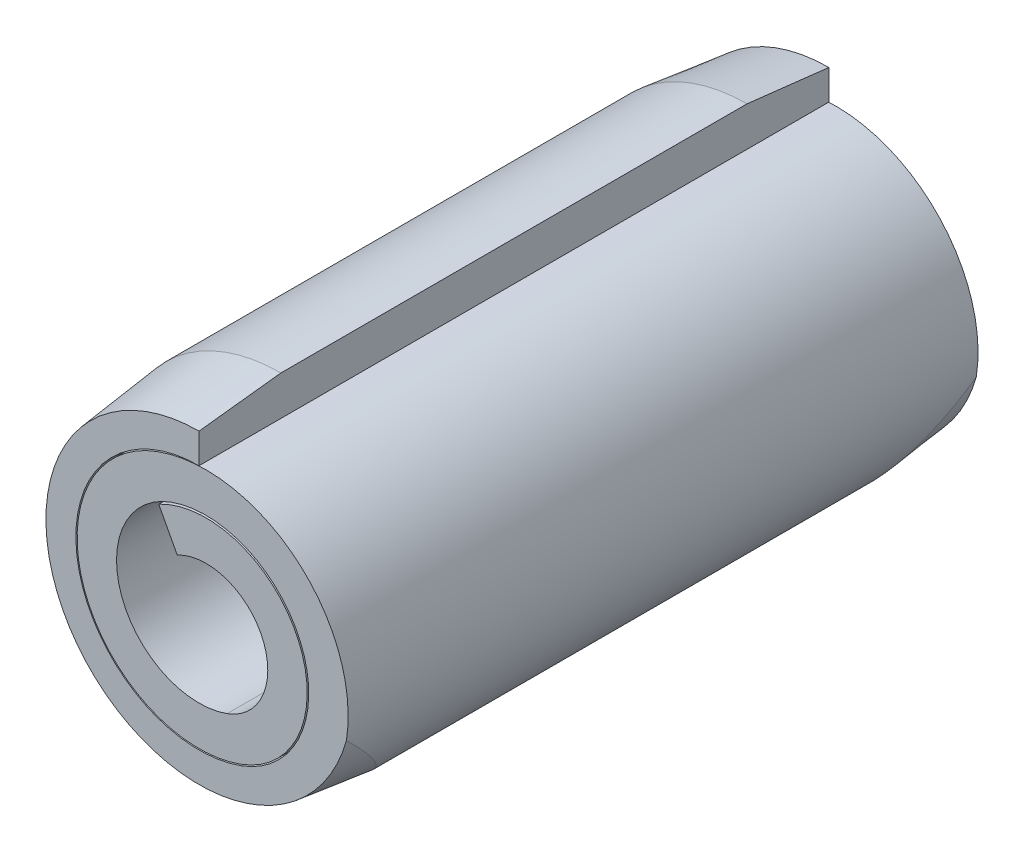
from build123d import *

# Parameters (mm, degrees)
EXTRUDE_THIN1_DEPTH = 6.35


with BuildPart() as part:
    # Sketch2 → Extrude-Thin1 (new, symmetric)
    with BuildSketch(Plane.XY):
        with BuildLine():
            ThreePointArc((0, 3.2766), (-3.226821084, -0.568975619), (1.120663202, -3.078996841))
            ThreePointArc((1.120663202, -3.078996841), (2.834205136, 0.595705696), (-0.840497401, 2.309247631))
            ThreePointArc((-0.840497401, 2.309247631), (-2.309247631, -0.840497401), (0.840497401, -2.309247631))
            ThreePointArc((0.840497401, -2.309247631), (2.005482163, 0.433633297), (-0.811561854, 1.405666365))
            Line((-0.811561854, 1.405666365), (-0.439138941, 0.703775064))
            ThreePointArc((-0.439138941, 0.703775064), (1.279461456, 0.110764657), (0.568736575, -1.562590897))
            ThreePointArc((0.568736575, -1.562590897), (-1.562590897, -0.568736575), (-0.568736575, 1.562590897))
            ThreePointArc((-0.568736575, 1.562590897), (2.087548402, 0.32394487), (0.848902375, -2.332340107))
            ThreePointArc((0.848902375, -2.332340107), (-2.444316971, -0.430999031), (0, 2.4820245))
            Line((0, 2.4820245), (0, 3.2766))
        make_face()
    extrude(amount=EXTRUDE_THIN1_DEPTH, both=True)

    # Sketch3 → Cut-Revolve1 (revolve, cut)
    with BuildSketch(Plane(origin=(0, 0, 0), x_dir=(0, 0, -1), z_dir=(1, 0, 0))):
        Polygon((-6.35, 3.2766), (-6.35, 3.0861), (-4.699, 3.2766), align=None)
        Polygon((4.699, 3.2766), (6.35, 3.2766), (6.35, 3.0861), align=None)
    revolve(axis=Axis((0, 0, 0), (0, 0, 1)), mode=Mode.SUBTRACT)


solid = part.part
